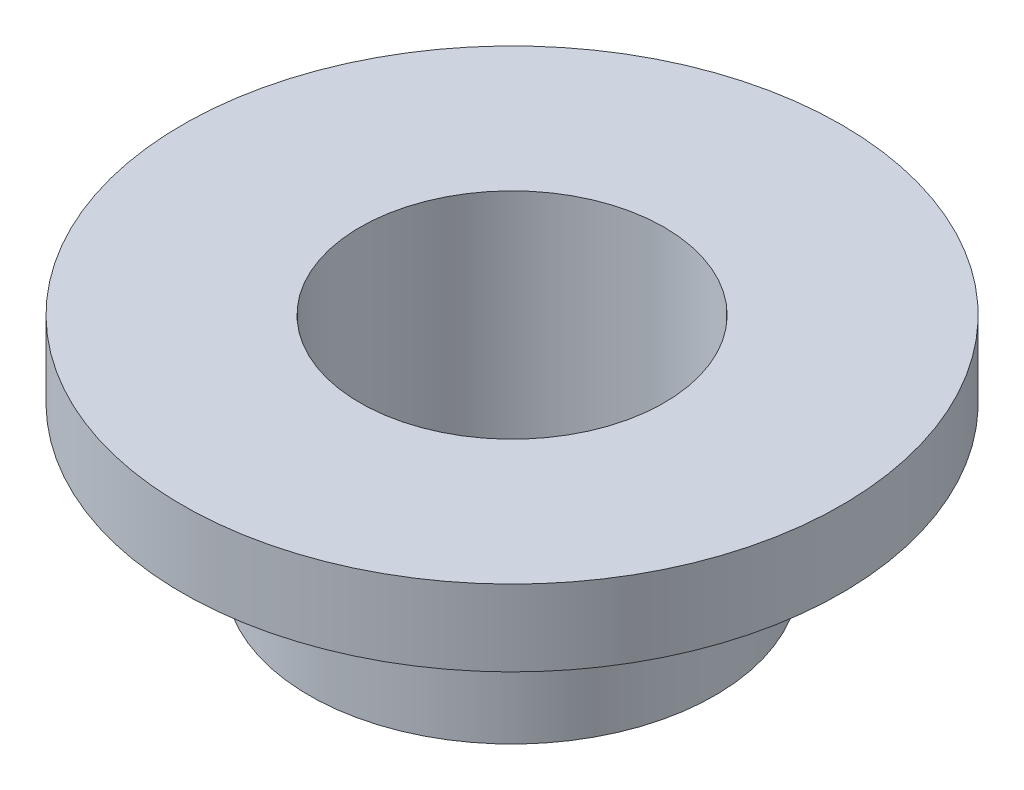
ISO-10303-21;
HEADER;
FILE_DESCRIPTION(('STEP AP214'),'2;1');
FILE_NAME('part.step','',(''),(''),'','','');
FILE_SCHEMA(('AUTOMOTIVE_DESIGN { 1 0 10303 214 1 1 1 1 }'));
ENDSEC;
DATA;
#1=APPLICATION_CONTEXT('core data for automotive mechanical design processes');
#2=APPLICATION_PROTOCOL_DEFINITION('international standard','automotive_design',2000,#1);
#3=PRODUCT_CONTEXT('',#1,'mechanical');
#4=PRODUCT('Part','Part','',(#3));
#5=PRODUCT_RELATED_PRODUCT_CATEGORY('part','',(#4));
#6=PRODUCT_DEFINITION_FORMATION('','',#4);
#7=PRODUCT_DEFINITION_CONTEXT('part definition',#1,'design');
#8=PRODUCT_DEFINITION('design','',#6,#7);
#9=PRODUCT_DEFINITION_SHAPE('','',#8);
#10=(LENGTH_UNIT() NAMED_UNIT(*) SI_UNIT(.MILLI.,.METRE.));
#11=(NAMED_UNIT(*) PLANE_ANGLE_UNIT() SI_UNIT($,.RADIAN.));
#12=(NAMED_UNIT(*) SI_UNIT($,.STERADIAN.) SOLID_ANGLE_UNIT());
#13=UNCERTAINTY_MEASURE_WITH_UNIT(LENGTH_MEASURE(1.E-05),#10,'distance_accuracy_value','');
#14=(GEOMETRIC_REPRESENTATION_CONTEXT(3) GLOBAL_UNCERTAINTY_ASSIGNED_CONTEXT((#13)) GLOBAL_UNIT_ASSIGNED_CONTEXT((#10,
#11,#12)) REPRESENTATION_CONTEXT('',''));
#15=CARTESIAN_POINT('',(0.,0.,0.));
#16=DIRECTION('',(0.,0.,1.));
#17=DIRECTION('',(1.,0.,0.));
#18=AXIS2_PLACEMENT_3D('',#15,#16,#17);
#19=CARTESIAN_POINT('',(8.,0.,0.));
#20=DIRECTION('',(0.,-1.,0.));
#21=DIRECTION('',(0.,0.,-1.));
#22=AXIS2_PLACEMENT_3D('',#19,#20,#21);
#23=PLANE('',#22);
#24=CARTESIAN_POINT('',(0.,0.,0.));
#25=DIRECTION('',(0.,-1.,0.));
#26=DIRECTION('',(0.,0.,-1.));
#27=AXIS2_PLACEMENT_3D('',#24,#25,#26);
#28=CIRCLE('',#27,8.);
#29=CARTESIAN_POINT('',(0.,0.,-8.));
#30=VERTEX_POINT('',#29);
#31=EDGE_CURVE('E10',#30,#30,#28,.T.);
#32=ORIENTED_EDGE('',*,*,#31,.T.);
#33=EDGE_LOOP('',(#32));
#34=FACE_BOUND('',#33,.T.);
#35=CARTESIAN_POINT('',(0.,0.,0.));
#36=DIRECTION('',(0.,-1.,0.));
#37=DIRECTION('',(0.,0.,-1.));
#38=AXIS2_PLACEMENT_3D('',#35,#36,#37);
#39=CIRCLE('',#38,6.);
#40=CARTESIAN_POINT('',(0.,0.,-6.));
#41=VERTEX_POINT('',#40);
#42=EDGE_CURVE('E370',#41,#41,#39,.T.);
#43=ORIENTED_EDGE('',*,*,#42,.F.);
#44=EDGE_LOOP('',(#43));
#45=FACE_BOUND('',#44,.T.);
#46=ADVANCED_FACE('F348',(#34,#45),#23,.T.);
#47=CARTESIAN_POINT('',(0.,0.,0.));
#48=DIRECTION('',(0.,-1.,0.));
#49=DIRECTION('',(0.,0.,-1.));
#50=AXIS2_PLACEMENT_3D('',#47,#48,#49);
#51=CYLINDRICAL_SURFACE('',#50,8.);
#52=CARTESIAN_POINT('',(0.,6.,0.));
#53=DIRECTION('',(0.,-1.,0.));
#54=DIRECTION('',(0.,0.,-1.));
#55=AXIS2_PLACEMENT_3D('',#52,#53,#54);
#56=CIRCLE('',#55,8.);
#57=CARTESIAN_POINT('',(0.,6.,-8.));
#58=VERTEX_POINT('',#57);
#59=EDGE_CURVE('E354',#58,#58,#56,.T.);
#60=ORIENTED_EDGE('',*,*,#59,.T.);
#61=EDGE_LOOP('',(#60));
#62=FACE_BOUND('',#61,.T.);
#63=ORIENTED_EDGE('',*,*,#31,.F.);
#64=EDGE_LOOP('',(#63));
#65=FACE_BOUND('',#64,.T.);
#66=ADVANCED_FACE('F378',(#62,#65),#51,.T.);
#67=CARTESIAN_POINT('',(13.,6.,0.));
#68=DIRECTION('',(0.,-1.,0.));
#69=DIRECTION('',(0.,0.,-1.));
#70=AXIS2_PLACEMENT_3D('',#67,#68,#69);
#71=PLANE('',#70);
#72=CARTESIAN_POINT('',(0.,6.,0.));
#73=DIRECTION('',(0.,-1.,0.));
#74=DIRECTION('',(0.,0.,-1.));
#75=AXIS2_PLACEMENT_3D('',#72,#73,#74);
#76=CIRCLE('',#75,13.);
#77=CARTESIAN_POINT('',(0.,6.,-13.));
#78=VERTEX_POINT('',#77);
#79=EDGE_CURVE('E358',#78,#78,#76,.T.);
#80=ORIENTED_EDGE('',*,*,#79,.T.);
#81=EDGE_LOOP('',(#80));
#82=FACE_BOUND('',#81,.T.);
#83=ORIENTED_EDGE('',*,*,#59,.F.);
#84=EDGE_LOOP('',(#83));
#85=FACE_BOUND('',#84,.T.);
#86=ADVANCED_FACE('F382',(#82,#85),#71,.T.);
#87=CARTESIAN_POINT('',(0.,0.,0.));
#88=DIRECTION('',(0.,-1.,0.));
#89=DIRECTION('',(0.,0.,-1.));
#90=AXIS2_PLACEMENT_3D('',#87,#88,#89);
#91=CYLINDRICAL_SURFACE('',#90,13.);
#92=CARTESIAN_POINT('',(0.,9.,0.));
#93=DIRECTION('',(0.,-1.,0.));
#94=DIRECTION('',(0.,0.,-1.));
#95=AXIS2_PLACEMENT_3D('',#92,#93,#94);
#96=CIRCLE('',#95,13.);
#97=CARTESIAN_POINT('',(0.,9.,-13.));
#98=VERTEX_POINT('',#97);
#99=EDGE_CURVE('E362',#98,#98,#96,.T.);
#100=ORIENTED_EDGE('',*,*,#99,.T.);
#101=EDGE_LOOP('',(#100));
#102=FACE_BOUND('',#101,.T.);
#103=ORIENTED_EDGE('',*,*,#79,.F.);
#104=EDGE_LOOP('',(#103));
#105=FACE_BOUND('',#104,.T.);
#106=ADVANCED_FACE('F386',(#102,#105),#91,.T.);
#107=CARTESIAN_POINT('',(6.,9.,0.));
#108=DIRECTION('',(0.,1.,0.));
#109=DIRECTION('',(0.,0.,1.));
#110=AXIS2_PLACEMENT_3D('',#107,#108,#109);
#111=PLANE('',#110);
#112=CARTESIAN_POINT('',(0.,9.,0.));
#113=DIRECTION('',(0.,-1.,0.));
#114=DIRECTION('',(0.,0.,-1.));
#115=AXIS2_PLACEMENT_3D('',#112,#113,#114);
#116=CIRCLE('',#115,6.);
#117=CARTESIAN_POINT('',(0.,9.,-6.));
#118=VERTEX_POINT('',#117);
#119=EDGE_CURVE('E367',#118,#118,#116,.T.);
#120=ORIENTED_EDGE('',*,*,#119,.T.);
#121=EDGE_LOOP('',(#120));
#122=FACE_BOUND('',#121,.T.);
#123=ORIENTED_EDGE('',*,*,#99,.F.);
#124=EDGE_LOOP('',(#123));
#125=FACE_BOUND('',#124,.T.);
#126=ADVANCED_FACE('F393',(#122,#125),#111,.T.);
#127=CARTESIAN_POINT('',(0.,0.,0.));
#128=DIRECTION('',(0.,-1.,0.));
#129=DIRECTION('',(0.,0.,-1.));
#130=AXIS2_PLACEMENT_3D('',#127,#128,#129);
#131=CYLINDRICAL_SURFACE('',#130,6.);
#132=ORIENTED_EDGE('',*,*,#42,.T.);
#133=EDGE_LOOP('',(#132));
#134=FACE_BOUND('',#133,.T.);
#135=ORIENTED_EDGE('',*,*,#119,.F.);
#136=EDGE_LOOP('',(#135));
#137=FACE_BOUND('',#136,.T.);
#138=ADVANCED_FACE('F374',(#134,#137),#131,.F.);
#139=CLOSED_SHELL('',(#46,#66,#86,#106,#126,#138));
#140=MANIFOLD_SOLID_BREP('B2',#139);
#141=ADVANCED_BREP_SHAPE_REPRESENTATION('',(#18,#140),#14);
#142=SHAPE_DEFINITION_REPRESENTATION(#9,#141);
ENDSEC;
END-ISO-10303-21;
